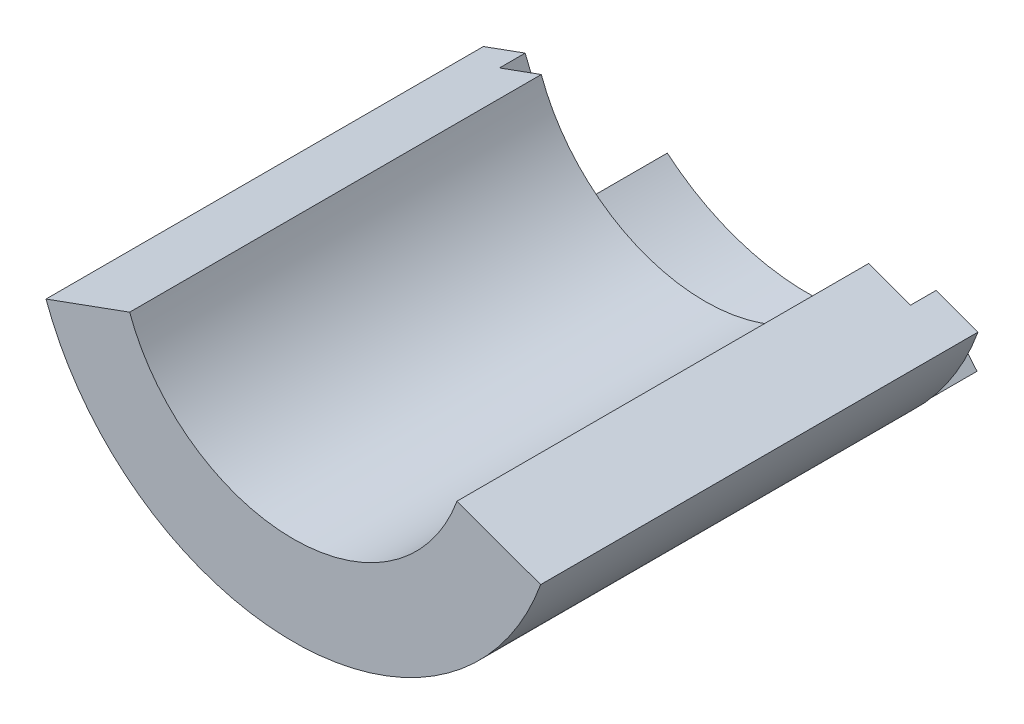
from build123d import *

# Parameters (mm, degrees)
BOSS_EXTRUDE1_DEPTH     = 3
BOSS_EXTRUDE2_DEPTH     = 17
CUT_EXTRUDE2_DEPTH      = 3
CUT_EXTRUDE2_DEPTH_BACK = 1
SKETCH3_R               = 8.5


with BuildPart() as part:
    # Sketch1 → Boss-Extrude1 (new body)
    with BuildSketch(Plane.XY):
        with BuildLine():
            Line((-4.351672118, -5.18612088), (-6.575717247, -7.836634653))
            ThreePointArc((-6.575717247, -7.836634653), (0, -10.23), (6.575717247, -7.836634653))
            Line((6.575717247, -7.836634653), (4.351672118, -5.18612088))
            ThreePointArc((4.351672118, -5.18612088), (0, -6.77), (-4.351672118, -5.18612088))
        make_face()
    extrude(amount=BOSS_EXTRUDE1_DEPTH)

    # Sketch2 → Boss-Extrude2 (add)
    with BuildSketch(Plane.XY.offset(3)):
        with BuildLine():
            Line((-6.361719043, -2.31547637), (-9.613055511, -3.498866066))
            ThreePointArc((-9.613055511, -3.498866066), (0, -10.23), (9.613055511, -3.498866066))
            Line((9.613055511, -3.498866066), (6.361719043, -2.31547637))
            ThreePointArc((6.361719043, -2.31547637), (0, -6.77), (-6.361719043, -2.31547637))
        make_face()
    extrude(amount=BOSS_EXTRUDE2_DEPTH)

    # Sketch3 → Cut-Extrude2 (cut, two sides: drawn at the far end of the back side and taken through both)
    with BuildSketch(Plane(origin=(0, 0, 3), x_dir=(-1, 0, 0), z_dir=(0, 0, -1)).offset(-CUT_EXTRUDE2_DEPTH_BACK)):
        Circle(SKETCH3_R)
    extrude(amount=CUT_EXTRUDE2_DEPTH + CUT_EXTRUDE2_DEPTH_BACK, mode=Mode.SUBTRACT)


solid = part.part
